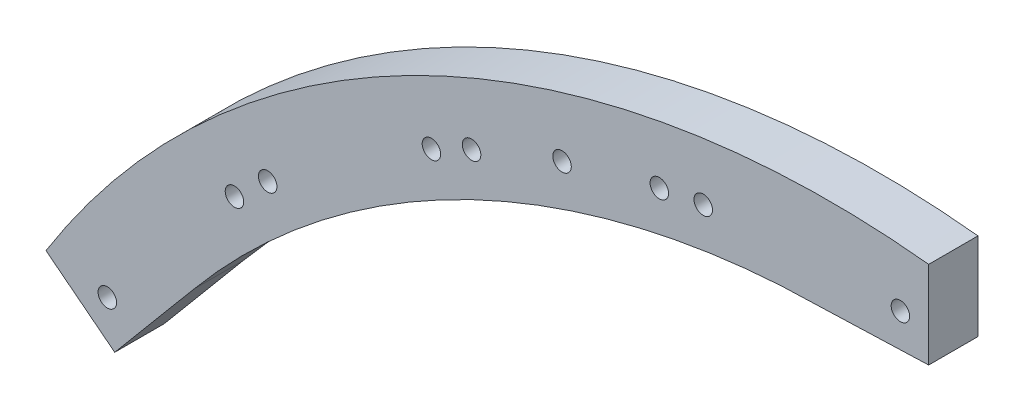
from build123d import *

# Parameters (mm, degrees)
BOSS_EXTRUDE1_DEPTH   = 3.175
F_0_80_TAPPED_HOLE1_D = 1.19126


with BuildPart() as part:
    # Sketch1 → Boss-Extrude1 (new body)
    with BuildSketch(Plane.XY):
        with BuildLine():
            Line((0, 0), (0, 5.61490736))
            ThreePointArc((0, 5.61490736), (-32.386160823, -0.045984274), (-56.828666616, -22.034004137))
            Line((-56.828666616, -22.034004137), (-52.404059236, -25.490886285))
            Line((-52.404059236, -25.490886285), (-47.298822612, -19.406702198))
            ThreePointArc((-47.298822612, -19.406702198), (-30.384328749, -5.963536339), (-9.525, -0.332620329))
            Line((-9.525, -0.332620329), (0, 0))
        make_face()
    extrude(amount=BOSS_EXTRUDE1_DEPTH)

    # 0-80 Tapped Hole1 (through all)
    with Locations(Plane.XY.offset(3.175)):
        with Locations((-1.821018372, 2.100486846), (-14.514205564, 1.684555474), (-17.34317728, 1.192002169), (-29.430006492, -2.706530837), (-32.013622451, -3.959775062), (-42.557647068, -11.038867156), (-44.695737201, -12.955703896), (-52.880041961, -22.666891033), (-23.604742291, -0.446376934)):
            Hole(F_0_80_TAPPED_HOLE1_D / 2)


solid = part.part
